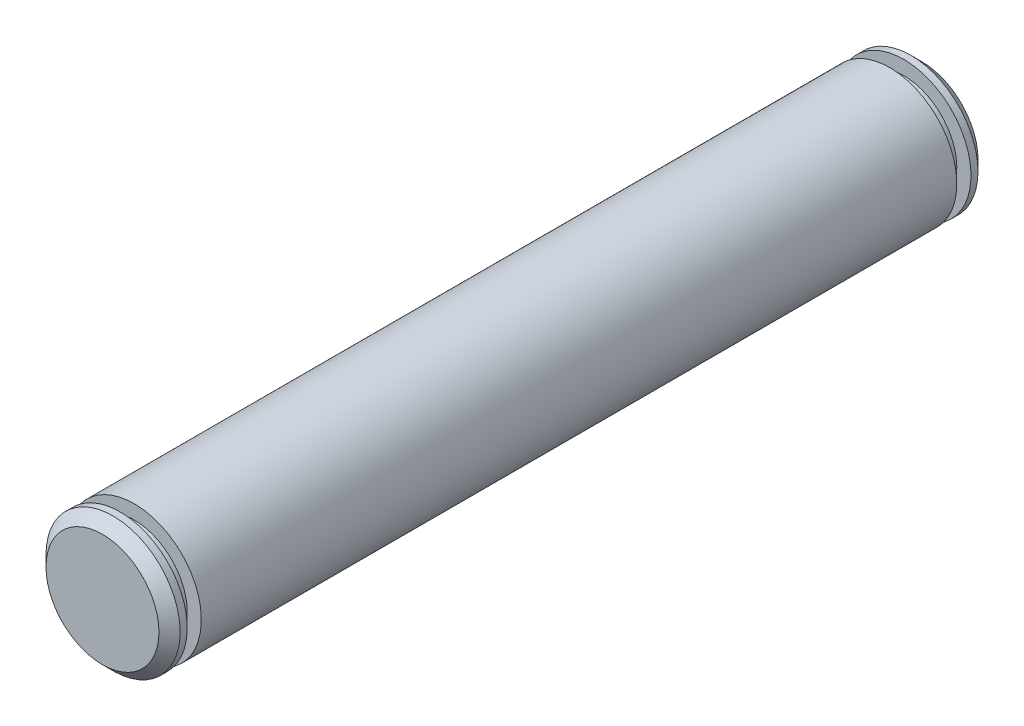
ISO-10303-21;
HEADER;
FILE_DESCRIPTION(('STEP AP214'),'2;1');
FILE_NAME('part.step','',(''),(''),'','','');
FILE_SCHEMA(('AUTOMOTIVE_DESIGN { 1 0 10303 214 1 1 1 1 }'));
ENDSEC;
DATA;
#1=APPLICATION_CONTEXT('core data for automotive mechanical design processes');
#2=APPLICATION_PROTOCOL_DEFINITION('international standard','automotive_design',2000,#1);
#3=PRODUCT_CONTEXT('',#1,'mechanical');
#4=PRODUCT('Part','Part','',(#3));
#5=PRODUCT_RELATED_PRODUCT_CATEGORY('part','',(#4));
#6=PRODUCT_DEFINITION_FORMATION('','',#4);
#7=PRODUCT_DEFINITION_CONTEXT('part definition',#1,'design');
#8=PRODUCT_DEFINITION('design','',#6,#7);
#9=PRODUCT_DEFINITION_SHAPE('','',#8);
#10=(LENGTH_UNIT() NAMED_UNIT(*) SI_UNIT(.MILLI.,.METRE.));
#11=(NAMED_UNIT(*) PLANE_ANGLE_UNIT() SI_UNIT($,.RADIAN.));
#12=(NAMED_UNIT(*) SI_UNIT($,.STERADIAN.) SOLID_ANGLE_UNIT());
#13=UNCERTAINTY_MEASURE_WITH_UNIT(LENGTH_MEASURE(1.E-05),#10,'distance_accuracy_value','');
#14=(GEOMETRIC_REPRESENTATION_CONTEXT(3) GLOBAL_UNCERTAINTY_ASSIGNED_CONTEXT((#13)) GLOBAL_UNIT_ASSIGNED_CONTEXT((#10,
#11,#12)) REPRESENTATION_CONTEXT('',''));
#15=CARTESIAN_POINT('',(0.,0.,0.));
#16=DIRECTION('',(0.,0.,1.));
#17=DIRECTION('',(1.,0.,0.));
#18=AXIS2_PLACEMENT_3D('',#15,#16,#17);
#19=CARTESIAN_POINT('',(0.,0.,116.));
#20=DIRECTION('',(0.,0.,-1.));
#21=DIRECTION('',(-1.,0.,0.));
#22=AXIS2_PLACEMENT_3D('',#19,#20,#21);
#23=CYLINDRICAL_SURFACE('',#22,9.5);
#24=CARTESIAN_POINT('',(0.,0.,4.5));
#25=DIRECTION('',(0.,0.,1.));
#26=DIRECTION('',(1.,0.,0.));
#27=AXIS2_PLACEMENT_3D('',#24,#25,#26);
#28=CIRCLE('',#27,9.5);
#29=CARTESIAN_POINT('',(-9.5,0.,4.5));
#30=VERTEX_POINT('',#29);
#31=EDGE_CURVE('E61',#30,#30,#28,.T.);
#32=CARTESIAN_POINT('',(0.,0.,111.5));
#33=DIRECTION('',(0.,0.,1.));
#34=DIRECTION('',(1.,0.,0.));
#35=AXIS2_PLACEMENT_3D('',#32,#33,#34);
#36=CIRCLE('',#35,9.5);
#37=CARTESIAN_POINT('',(-9.5,0.,111.5));
#38=VERTEX_POINT('',#37);
#39=EDGE_CURVE('E57',#38,#38,#36,.T.);
#40=CARTESIAN_POINT('',(-9.5,0.,4.5));
#41=CARTESIAN_POINT('',(-9.5,0.,5.61458333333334));
#42=CARTESIAN_POINT('',(-9.5,0.,6.72916666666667));
#43=CARTESIAN_POINT('',(-9.5,0.,8.95833333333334));
#44=CARTESIAN_POINT('',(-9.5,0.,10.0729166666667));
#45=CARTESIAN_POINT('',(-9.5,0.,12.3020833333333));
#46=CARTESIAN_POINT('',(-9.5,0.,13.4166666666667));
#47=CARTESIAN_POINT('',(-9.5,0.,15.6458333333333));
#48=CARTESIAN_POINT('',(-9.5,0.,16.7604166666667));
#49=CARTESIAN_POINT('',(-9.5,0.,18.9895833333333));
#50=CARTESIAN_POINT('',(-9.5,0.,20.1041666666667));
#51=CARTESIAN_POINT('',(-9.5,0.,22.3333333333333));
#52=CARTESIAN_POINT('',(-9.5,0.,23.4479166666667));
#53=CARTESIAN_POINT('',(-9.5,0.,25.6770833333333));
#54=CARTESIAN_POINT('',(-9.5,0.,26.7916666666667));
#55=CARTESIAN_POINT('',(-9.5,0.,29.0208333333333));
#56=CARTESIAN_POINT('',(-9.5,0.,30.1354166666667));
#57=CARTESIAN_POINT('',(-9.5,0.,32.3645833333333));
#58=CARTESIAN_POINT('',(-9.5,0.,33.4791666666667));
#59=CARTESIAN_POINT('',(-9.5,0.,35.7083333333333));
#60=CARTESIAN_POINT('',(-9.5,0.,36.8229166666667));
#61=CARTESIAN_POINT('',(-9.5,0.,39.0520833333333));
#62=CARTESIAN_POINT('',(-9.5,0.,40.1666666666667));
#63=CARTESIAN_POINT('',(-9.5,0.,42.3958333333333));
#64=CARTESIAN_POINT('',(-9.5,0.,43.5104166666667));
#65=CARTESIAN_POINT('',(-9.5,0.,45.7395833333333));
#66=CARTESIAN_POINT('',(-9.5,0.,46.8541666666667));
#67=CARTESIAN_POINT('',(-9.5,0.,49.0833333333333));
#68=CARTESIAN_POINT('',(-9.5,0.,50.1979166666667));
#69=CARTESIAN_POINT('',(-9.5,0.,52.4270833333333));
#70=CARTESIAN_POINT('',(-9.5,0.,53.5416666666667));
#71=CARTESIAN_POINT('',(-9.5,0.,55.7708333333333));
#72=CARTESIAN_POINT('',(-9.5,0.,56.8854166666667));
#73=CARTESIAN_POINT('',(-9.5,0.,59.1145833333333));
#74=CARTESIAN_POINT('',(-9.5,0.,60.2291666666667));
#75=CARTESIAN_POINT('',(-9.5,0.,62.4583333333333));
#76=CARTESIAN_POINT('',(-9.5,0.,63.5729166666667));
#77=CARTESIAN_POINT('',(-9.5,0.,65.8020833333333));
#78=CARTESIAN_POINT('',(-9.5,0.,66.9166666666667));
#79=CARTESIAN_POINT('',(-9.5,0.,69.1458333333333));
#80=CARTESIAN_POINT('',(-9.5,0.,70.2604166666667));
#81=CARTESIAN_POINT('',(-9.5,0.,72.4895833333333));
#82=CARTESIAN_POINT('',(-9.5,0.,73.6041666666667));
#83=CARTESIAN_POINT('',(-9.5,0.,75.8333333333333));
#84=CARTESIAN_POINT('',(-9.5,0.,76.9479166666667));
#85=CARTESIAN_POINT('',(-9.5,0.,79.1770833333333));
#86=CARTESIAN_POINT('',(-9.5,0.,80.2916666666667));
#87=CARTESIAN_POINT('',(-9.5,0.,82.5208333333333));
#88=CARTESIAN_POINT('',(-9.5,0.,83.6354166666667));
#89=CARTESIAN_POINT('',(-9.5,0.,85.8645833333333));
#90=CARTESIAN_POINT('',(-9.5,0.,86.9791666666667));
#91=CARTESIAN_POINT('',(-9.5,0.,89.2083333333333));
#92=CARTESIAN_POINT('',(-9.5,0.,90.3229166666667));
#93=CARTESIAN_POINT('',(-9.5,0.,92.5520833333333));
#94=CARTESIAN_POINT('',(-9.5,0.,93.6666666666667));
#95=CARTESIAN_POINT('',(-9.5,0.,95.8958333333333));
#96=CARTESIAN_POINT('',(-9.5,0.,97.0104166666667));
#97=CARTESIAN_POINT('',(-9.5,0.,99.2395833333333));
#98=CARTESIAN_POINT('',(-9.5,0.,100.354166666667));
#99=CARTESIAN_POINT('',(-9.5,0.,102.583333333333));
#100=CARTESIAN_POINT('',(-9.5,0.,103.697916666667));
#101=CARTESIAN_POINT('',(-9.5,0.,105.927083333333));
#102=CARTESIAN_POINT('',(-9.5,0.,107.041666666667));
#103=CARTESIAN_POINT('',(-9.5,0.,109.270833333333));
#104=CARTESIAN_POINT('',(-9.5,0.,110.385416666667));
#105=CARTESIAN_POINT('',(-9.5,0.,111.5));
#106=B_SPLINE_CURVE_WITH_KNOTS('',3,(#40,#41,#42,#43,#44,#45,#46,#47,#48,#49,#50,#51,#52,#53,
#54,#55,#56,#57,#58,#59,#60,#61,#62,#63,#64,#65,#66,#67,#68,#69,#70,#71,#72,#73,#74,#75,#76,#77,
#78,#79,#80,#81,#82,#83,#84,#85,#86,#87,#88,#89,#90,#91,#92,#93,#94,#95,#96,#97,#98,#99,#100,
#101,#102,#103,#104,#105),.UNSPECIFIED.,.F.,.F.,(4,2,2,2,2,2,2,2,2,2,2,2,2,2,2,2,2,2,2,2,2,2,2,
2,2,2,2,2,2,2,2,2,4),(0.,3.34375000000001,6.6875,10.03125,13.375,16.71875,20.0625,23.40625,
26.75,30.09375,33.4375,36.78125,40.125,43.46875,46.8125,50.15625,53.5,56.84375,60.1875,63.53125,
66.875,70.21875,73.5625,76.90625,80.25,83.59375,86.9375,90.28125,93.625,96.96875,100.3125,
103.65625,107.),.UNSPECIFIED.);
#107=EDGE_CURVE('BSEAM37',#30,#38,#106,.T.);
#108=ORIENTED_EDGE('',*,*,#31,.T.);
#109=ORIENTED_EDGE('',*,*,#39,.F.);
#110=ORIENTED_EDGE('',*,*,#107,.T.);
#111=ORIENTED_EDGE('',*,*,#107,.F.);
#112=EDGE_LOOP('',(#108,#110,#109,#111));
#113=FACE_BOUND('',#112,.T.);
#114=ADVANCED_FACE('F37',(#113),#23,.T.);
#115=CARTESIAN_POINT('',(0.,0.,111.5));
#116=DIRECTION('',(0.,0.,1.));
#117=DIRECTION('',(1.,0.,0.));
#118=AXIS2_PLACEMENT_3D('',#115,#116,#117);
#119=PLANE('',#118);
#120=CARTESIAN_POINT('',(0.,0.,111.5));
#121=DIRECTION('',(0.,0.,1.));
#122=DIRECTION('',(1.,0.,0.));
#123=AXIS2_PLACEMENT_3D('',#120,#121,#122);
#124=CIRCLE('',#123,7.5);
#125=CARTESIAN_POINT('',(7.5,0.,111.5));
#126=VERTEX_POINT('',#125);
#127=EDGE_CURVE('E58',#126,#126,#124,.T.);
#128=ORIENTED_EDGE('',*,*,#127,.F.);
#129=EDGE_LOOP('',(#128));
#130=FACE_BOUND('',#129,.T.);
#131=ORIENTED_EDGE('',*,*,#39,.T.);
#132=EDGE_LOOP('',(#131));
#133=FACE_BOUND('',#132,.T.);
#134=ADVANCED_FACE('F101',(#130,#133),#119,.T.);
#135=CARTESIAN_POINT('',(0.,0.,113.5));
#136=DIRECTION('',(0.,0.,1.));
#137=DIRECTION('',(1.,0.,0.));
#138=AXIS2_PLACEMENT_3D('',#135,#136,#137);
#139=PLANE('',#138);
#140=CARTESIAN_POINT('',(0.,0.,113.5));
#141=DIRECTION('',(0.,0.,1.));
#142=DIRECTION('',(1.,0.,0.));
#143=AXIS2_PLACEMENT_3D('',#140,#141,#142);
#144=CIRCLE('',#143,7.5);
#145=CARTESIAN_POINT('',(7.5,0.,113.5));
#146=VERTEX_POINT('',#145);
#147=EDGE_CURVE('E67',#146,#146,#144,.T.);
#148=ORIENTED_EDGE('',*,*,#147,.T.);
#149=EDGE_LOOP('',(#148));
#150=FACE_BOUND('',#149,.T.);
#151=CARTESIAN_POINT('',(0.,0.,113.5));
#152=DIRECTION('',(0.,0.,1.));
#153=DIRECTION('',(1.,0.,0.));
#154=AXIS2_PLACEMENT_3D('',#151,#152,#153);
#155=CIRCLE('',#154,9.5);
#156=CARTESIAN_POINT('',(-9.5,0.,113.5));
#157=VERTEX_POINT('',#156);
#158=EDGE_CURVE('E54',#157,#157,#155,.T.);
#159=ORIENTED_EDGE('',*,*,#158,.F.);
#160=EDGE_LOOP('',(#159));
#161=FACE_BOUND('',#160,.T.);
#162=ADVANCED_FACE('F105',(#150,#161),#139,.F.);
#163=CARTESIAN_POINT('',(0.,0.,111.5));
#164=DIRECTION('',(0.,0.,1.));
#165=DIRECTION('',(1.,0.,0.));
#166=AXIS2_PLACEMENT_3D('',#163,#164,#165);
#167=CYLINDRICAL_SURFACE('',#166,7.5);
#168=ORIENTED_EDGE('',*,*,#127,.T.);
#169=EDGE_LOOP('',(#168));
#170=FACE_BOUND('',#169,.T.);
#171=ORIENTED_EDGE('',*,*,#147,.F.);
#172=EDGE_LOOP('',(#171));
#173=FACE_BOUND('',#172,.T.);
#174=ADVANCED_FACE('F128',(#170,#173),#167,.T.);
#175=CARTESIAN_POINT('',(0.,0.,116.));
#176=DIRECTION('',(0.,0.,1.));
#177=DIRECTION('',(1.,0.,0.));
#178=AXIS2_PLACEMENT_3D('',#175,#176,#177);
#179=PLANE('',#178);
#180=CARTESIAN_POINT('',(0.,0.,116.));
#181=DIRECTION('',(0.,0.,1.));
#182=DIRECTION('',(1.,0.,0.));
#183=AXIS2_PLACEMENT_3D('',#180,#181,#182);
#184=CIRCLE('',#183,8.);
#185=CARTESIAN_POINT('',(8.,0.,116.));
#186=VERTEX_POINT('',#185);
#187=EDGE_CURVE('E60',#186,#186,#184,.T.);
#188=ORIENTED_EDGE('',*,*,#187,.T.);
#189=EDGE_LOOP('',(#188));
#190=FACE_BOUND('',#189,.T.);
#191=ADVANCED_FACE('F119',(#190),#179,.T.);
#192=CARTESIAN_POINT('',(0.,0.,116.));
#193=DIRECTION('',(0.,0.,-1.));
#194=DIRECTION('',(-1.,0.,0.));
#195=AXIS2_PLACEMENT_3D('',#192,#193,#194);
#196=CONICAL_SURFACE('',#195,8.,0.785398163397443);
#197=CARTESIAN_POINT('',(0.,0.,114.5));
#198=DIRECTION('',(0.,0.,1.));
#199=DIRECTION('',(1.,0.,0.));
#200=AXIS2_PLACEMENT_3D('',#197,#198,#199);
#201=CIRCLE('',#200,9.5);
#202=CARTESIAN_POINT('',(-9.5,0.,114.5));
#203=VERTEX_POINT('',#202);
#204=EDGE_CURVE('E45',#203,#203,#201,.F.);
#205=ORIENTED_EDGE('',*,*,#204,.F.);
#206=EDGE_LOOP('',(#205));
#207=FACE_BOUND('',#206,.T.);
#208=ORIENTED_EDGE('',*,*,#187,.F.);
#209=EDGE_LOOP('',(#208));
#210=FACE_BOUND('',#209,.T.);
#211=ADVANCED_FACE('F110',(#207,#210),#196,.T.);
#212=CARTESIAN_POINT('',(-9.5,0.,113.5));
#213=CARTESIAN_POINT('',(-9.5,0.,113.510416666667));
#214=CARTESIAN_POINT('',(-9.5,0.,113.520833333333));
#215=CARTESIAN_POINT('',(-9.5,0.,113.541666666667));
#216=CARTESIAN_POINT('',(-9.5,0.,113.552083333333));
#217=CARTESIAN_POINT('',(-9.5,0.,113.572916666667));
#218=CARTESIAN_POINT('',(-9.5,0.,113.583333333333));
#219=CARTESIAN_POINT('',(-9.5,0.,113.604166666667));
#220=CARTESIAN_POINT('',(-9.5,0.,113.614583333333));
#221=CARTESIAN_POINT('',(-9.5,0.,113.635416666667));
#222=CARTESIAN_POINT('',(-9.5,0.,113.645833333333));
#223=CARTESIAN_POINT('',(-9.5,0.,113.666666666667));
#224=CARTESIAN_POINT('',(-9.5,0.,113.677083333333));
#225=CARTESIAN_POINT('',(-9.5,0.,113.697916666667));
#226=CARTESIAN_POINT('',(-9.5,0.,113.708333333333));
#227=CARTESIAN_POINT('',(-9.5,0.,113.729166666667));
#228=CARTESIAN_POINT('',(-9.5,0.,113.739583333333));
#229=CARTESIAN_POINT('',(-9.5,0.,113.760416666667));
#230=CARTESIAN_POINT('',(-9.5,0.,113.770833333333));
#231=CARTESIAN_POINT('',(-9.5,0.,113.791666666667));
#232=CARTESIAN_POINT('',(-9.5,0.,113.802083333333));
#233=CARTESIAN_POINT('',(-9.5,0.,113.822916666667));
#234=CARTESIAN_POINT('',(-9.5,0.,113.833333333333));
#235=CARTESIAN_POINT('',(-9.5,0.,113.854166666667));
#236=CARTESIAN_POINT('',(-9.5,0.,113.864583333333));
#237=CARTESIAN_POINT('',(-9.5,0.,113.885416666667));
#238=CARTESIAN_POINT('',(-9.5,0.,113.895833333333));
#239=CARTESIAN_POINT('',(-9.5,0.,113.916666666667));
#240=CARTESIAN_POINT('',(-9.5,0.,113.927083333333));
#241=CARTESIAN_POINT('',(-9.5,0.,113.947916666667));
#242=CARTESIAN_POINT('',(-9.5,0.,113.958333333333));
#243=CARTESIAN_POINT('',(-9.5,0.,113.979166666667));
#244=CARTESIAN_POINT('',(-9.5,0.,113.989583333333));
#245=CARTESIAN_POINT('',(-9.5,0.,114.010416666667));
#246=CARTESIAN_POINT('',(-9.5,0.,114.020833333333));
#247=CARTESIAN_POINT('',(-9.5,0.,114.041666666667));
#248=CARTESIAN_POINT('',(-9.5,0.,114.052083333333));
#249=CARTESIAN_POINT('',(-9.5,0.,114.072916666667));
#250=CARTESIAN_POINT('',(-9.5,0.,114.083333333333));
#251=CARTESIAN_POINT('',(-9.5,0.,114.104166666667));
#252=CARTESIAN_POINT('',(-9.5,0.,114.114583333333));
#253=CARTESIAN_POINT('',(-9.5,0.,114.135416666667));
#254=CARTESIAN_POINT('',(-9.5,0.,114.145833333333));
#255=CARTESIAN_POINT('',(-9.5,0.,114.166666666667));
#256=CARTESIAN_POINT('',(-9.5,0.,114.177083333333));
#257=CARTESIAN_POINT('',(-9.5,0.,114.197916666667));
#258=CARTESIAN_POINT('',(-9.5,0.,114.208333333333));
#259=CARTESIAN_POINT('',(-9.5,0.,114.229166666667));
#260=CARTESIAN_POINT('',(-9.5,0.,114.239583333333));
#261=CARTESIAN_POINT('',(-9.5,0.,114.260416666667));
#262=CARTESIAN_POINT('',(-9.5,0.,114.270833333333));
#263=CARTESIAN_POINT('',(-9.5,0.,114.291666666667));
#264=CARTESIAN_POINT('',(-9.5,0.,114.302083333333));
#265=CARTESIAN_POINT('',(-9.5,0.,114.322916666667));
#266=CARTESIAN_POINT('',(-9.5,0.,114.333333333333));
#267=CARTESIAN_POINT('',(-9.5,0.,114.354166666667));
#268=CARTESIAN_POINT('',(-9.5,0.,114.364583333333));
#269=CARTESIAN_POINT('',(-9.5,0.,114.385416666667));
#270=CARTESIAN_POINT('',(-9.5,0.,114.395833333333));
#271=CARTESIAN_POINT('',(-9.5,0.,114.416666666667));
#272=CARTESIAN_POINT('',(-9.5,0.,114.427083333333));
#273=CARTESIAN_POINT('',(-9.5,0.,114.447916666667));
#274=CARTESIAN_POINT('',(-9.5,0.,114.458333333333));
#275=CARTESIAN_POINT('',(-9.5,0.,114.479166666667));
#276=CARTESIAN_POINT('',(-9.5,0.,114.489583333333));
#277=CARTESIAN_POINT('',(-9.5,0.,114.5));
#278=B_SPLINE_CURVE_WITH_KNOTS('',3,(#212,#213,#214,#215,#216,#217,#218,#219,#220,#221,#222,
#223,#224,#225,#226,#227,#228,#229,#230,#231,#232,#233,#234,#235,#236,#237,#238,#239,#240,#241,
#242,#243,#244,#245,#246,#247,#248,#249,#250,#251,#252,#253,#254,#255,#256,#257,#258,#259,#260,
#261,#262,#263,#264,#265,#266,#267,#268,#269,#270,#271,#272,#273,#274,#275,#276,#277),
.UNSPECIFIED.,.F.,.F.,(4,2,2,2,2,2,2,2,2,2,2,2,2,2,2,2,2,2,2,2,2,2,2,2,2,2,2,2,2,2,2,2,4),(0.,
0.0312499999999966,0.0624999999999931,0.0937499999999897,0.124999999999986,0.156249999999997,
0.187499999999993,0.21874999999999,0.249999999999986,0.281249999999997,0.312499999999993,
0.34374999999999,0.374999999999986,0.406249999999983,0.437499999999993,0.46874999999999,
0.499999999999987,0.531249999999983,0.56249999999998,0.59374999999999,0.624999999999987,
0.656249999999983,0.68749999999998,0.71874999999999,0.749999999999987,0.781249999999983,
0.81249999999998,0.843749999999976,0.874999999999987,0.906249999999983,0.93749999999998,
0.968749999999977,0.999999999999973),.UNSPECIFIED.);
#279=EDGE_CURVE('BSEAM39',#157,#203,#278,.T.);
#280=ORIENTED_EDGE('',*,*,#158,.T.);
#281=ORIENTED_EDGE('',*,*,#204,.T.);
#282=ORIENTED_EDGE('',*,*,#279,.T.);
#283=ORIENTED_EDGE('',*,*,#279,.F.);
#284=EDGE_LOOP('',(#280,#282,#281,#283));
#285=FACE_BOUND('',#284,.T.);
#286=ADVANCED_FACE('F39',(#285),#23,.T.);
#287=CARTESIAN_POINT('',(0.,0.,2.5));
#288=DIRECTION('',(0.,0.,1.));
#289=DIRECTION('',(1.,0.,0.));
#290=AXIS2_PLACEMENT_3D('',#287,#288,#289);
#291=PLANE('',#290);
#292=CARTESIAN_POINT('',(0.,0.,2.5));
#293=DIRECTION('',(0.,0.,1.));
#294=DIRECTION('',(1.,0.,0.));
#295=AXIS2_PLACEMENT_3D('',#292,#293,#294);
#296=CIRCLE('',#295,7.5);
#297=CARTESIAN_POINT('',(7.5,0.,2.5));
#298=VERTEX_POINT('',#297);
#299=EDGE_CURVE('E63',#298,#298,#296,.T.);
#300=ORIENTED_EDGE('',*,*,#299,.F.);
#301=EDGE_LOOP('',(#300));
#302=FACE_BOUND('',#301,.T.);
#303=CARTESIAN_POINT('',(0.,0.,2.5));
#304=DIRECTION('',(0.,0.,1.));
#305=DIRECTION('',(1.,0.,0.));
#306=AXIS2_PLACEMENT_3D('',#303,#304,#305);
#307=CIRCLE('',#306,9.5);
#308=CARTESIAN_POINT('',(-9.5,0.,2.5));
#309=VERTEX_POINT('',#308);
#310=EDGE_CURVE('E41',#309,#309,#307,.T.);
#311=ORIENTED_EDGE('',*,*,#310,.T.);
#312=EDGE_LOOP('',(#311));
#313=FACE_BOUND('',#312,.T.);
#314=ADVANCED_FACE('F109',(#302,#313),#291,.T.);
#315=CARTESIAN_POINT('',(0.,0.,4.5));
#316=DIRECTION('',(0.,0.,1.));
#317=DIRECTION('',(1.,0.,0.));
#318=AXIS2_PLACEMENT_3D('',#315,#316,#317);
#319=PLANE('',#318);
#320=CARTESIAN_POINT('',(0.,0.,4.5));
#321=DIRECTION('',(0.,0.,1.));
#322=DIRECTION('',(1.,0.,0.));
#323=AXIS2_PLACEMENT_3D('',#320,#321,#322);
#324=CIRCLE('',#323,7.5);
#325=CARTESIAN_POINT('',(7.5,0.,4.5));
#326=VERTEX_POINT('',#325);
#327=EDGE_CURVE('E69',#326,#326,#324,.T.);
#328=ORIENTED_EDGE('',*,*,#327,.T.);
#329=EDGE_LOOP('',(#328));
#330=FACE_BOUND('',#329,.T.);
#331=ORIENTED_EDGE('',*,*,#31,.F.);
#332=EDGE_LOOP('',(#331));
#333=FACE_BOUND('',#332,.T.);
#334=ADVANCED_FACE('F116',(#330,#333),#319,.F.);
#335=CARTESIAN_POINT('',(0.,0.,2.5));
#336=DIRECTION('',(0.,0.,1.));
#337=DIRECTION('',(1.,0.,0.));
#338=AXIS2_PLACEMENT_3D('',#335,#336,#337);
#339=CYLINDRICAL_SURFACE('',#338,7.5);
#340=ORIENTED_EDGE('',*,*,#299,.T.);
#341=EDGE_LOOP('',(#340));
#342=FACE_BOUND('',#341,.T.);
#343=ORIENTED_EDGE('',*,*,#327,.F.);
#344=EDGE_LOOP('',(#343));
#345=FACE_BOUND('',#344,.T.);
#346=ADVANCED_FACE('F96',(#342,#345),#339,.T.);
#347=CARTESIAN_POINT('',(0.,0.,0.));
#348=DIRECTION('',(0.,0.,1.));
#349=DIRECTION('',(1.,0.,0.));
#350=AXIS2_PLACEMENT_3D('',#347,#348,#349);
#351=PLANE('',#350);
#352=CARTESIAN_POINT('',(0.,0.,0.));
#353=DIRECTION('',(0.,0.,1.));
#354=DIRECTION('',(1.,0.,0.));
#355=AXIS2_PLACEMENT_3D('',#352,#353,#354);
#356=CIRCLE('',#355,7.99999999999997);
#357=CARTESIAN_POINT('',(7.99999999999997,0.,0.));
#358=VERTEX_POINT('',#357);
#359=EDGE_CURVE('E10',#358,#358,#356,.F.);
#360=ORIENTED_EDGE('',*,*,#359,.T.);
#361=EDGE_LOOP('',(#360));
#362=FACE_BOUND('',#361,.T.);
#363=ADVANCED_FACE('F89',(#362),#351,.F.);
#364=CARTESIAN_POINT('',(0.,0.,1.50000000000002));
#365=DIRECTION('',(0.,0.,1.));
#366=DIRECTION('',(1.,0.,0.));
#367=AXIS2_PLACEMENT_3D('',#364,#365,#366);
#368=CONICAL_SURFACE('',#367,9.5,0.785398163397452);
#369=ORIENTED_EDGE('',*,*,#359,.F.);
#370=EDGE_LOOP('',(#369));
#371=FACE_BOUND('',#370,.T.);
#372=CARTESIAN_POINT('',(0.,0.,1.50000000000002));
#373=DIRECTION('',(0.,0.,1.));
#374=DIRECTION('',(1.,0.,0.));
#375=AXIS2_PLACEMENT_3D('',#372,#373,#374);
#376=CIRCLE('',#375,9.5);
#377=CARTESIAN_POINT('',(-9.5,0.,1.5));
#378=VERTEX_POINT('',#377);
#379=EDGE_CURVE('E50',#378,#378,#376,.T.);
#380=ORIENTED_EDGE('',*,*,#379,.F.);
#381=EDGE_LOOP('',(#380));
#382=FACE_BOUND('',#381,.T.);
#383=ADVANCED_FACE('F87',(#371,#382),#368,.T.);
#384=CARTESIAN_POINT('',(-9.5,0.,1.5));
#385=CARTESIAN_POINT('',(-9.5,0.,1.51041666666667));
#386=CARTESIAN_POINT('',(-9.5,0.,1.52083333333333));
#387=CARTESIAN_POINT('',(-9.5,0.,1.54166666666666));
#388=CARTESIAN_POINT('',(-9.5,0.,1.55208333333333));
#389=CARTESIAN_POINT('',(-9.5,0.,1.57291666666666));
#390=CARTESIAN_POINT('',(-9.5,0.,1.58333333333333));
#391=CARTESIAN_POINT('',(-9.5,0.,1.60416666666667));
#392=CARTESIAN_POINT('',(-9.5,0.,1.61458333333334));
#393=CARTESIAN_POINT('',(-9.5,0.,1.63541666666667));
#394=CARTESIAN_POINT('',(-9.5,0.,1.64583333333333));
#395=CARTESIAN_POINT('',(-9.5,0.,1.66666666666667));
#396=CARTESIAN_POINT('',(-9.5,0.,1.67708333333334));
#397=CARTESIAN_POINT('',(-9.5,0.,1.69791666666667));
#398=CARTESIAN_POINT('',(-9.5,0.,1.70833333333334));
#399=CARTESIAN_POINT('',(-9.5,0.,1.72916666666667));
#400=CARTESIAN_POINT('',(-9.5,0.,1.73958333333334));
#401=CARTESIAN_POINT('',(-9.5,0.,1.76041666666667));
#402=CARTESIAN_POINT('',(-9.5,0.,1.77083333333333));
#403=CARTESIAN_POINT('',(-9.5,0.,1.79166666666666));
#404=CARTESIAN_POINT('',(-9.5,0.,1.80208333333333));
#405=CARTESIAN_POINT('',(-9.5,0.,1.82291666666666));
#406=CARTESIAN_POINT('',(-9.5,0.,1.83333333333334));
#407=CARTESIAN_POINT('',(-9.5,0.,1.85416666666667));
#408=CARTESIAN_POINT('',(-9.5,0.,1.86458333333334));
#409=CARTESIAN_POINT('',(-9.5,0.,1.88541666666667));
#410=CARTESIAN_POINT('',(-9.5,0.,1.89583333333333));
#411=CARTESIAN_POINT('',(-9.5,0.,1.91666666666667));
#412=CARTESIAN_POINT('',(-9.5,0.,1.92708333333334));
#413=CARTESIAN_POINT('',(-9.5,0.,1.94791666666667));
#414=CARTESIAN_POINT('',(-9.5,0.,1.95833333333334));
#415=CARTESIAN_POINT('',(-9.5,0.,1.97916666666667));
#416=CARTESIAN_POINT('',(-9.5,0.,1.98958333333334));
#417=CARTESIAN_POINT('',(-9.5,0.,2.01041666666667));
#418=CARTESIAN_POINT('',(-9.5,0.,2.02083333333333));
#419=CARTESIAN_POINT('',(-9.5,0.,2.04166666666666));
#420=CARTESIAN_POINT('',(-9.5,0.,2.05208333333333));
#421=CARTESIAN_POINT('',(-9.5,0.,2.07291666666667));
#422=CARTESIAN_POINT('',(-9.5,0.,2.08333333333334));
#423=CARTESIAN_POINT('',(-9.5,0.,2.10416666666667));
#424=CARTESIAN_POINT('',(-9.5,0.,2.11458333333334));
#425=CARTESIAN_POINT('',(-9.5,0.,2.13541666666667));
#426=CARTESIAN_POINT('',(-9.5,0.,2.14583333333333));
#427=CARTESIAN_POINT('',(-9.5,0.,2.16666666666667));
#428=CARTESIAN_POINT('',(-9.5,0.,2.17708333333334));
#429=CARTESIAN_POINT('',(-9.5,0.,2.19791666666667));
#430=CARTESIAN_POINT('',(-9.5,0.,2.20833333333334));
#431=CARTESIAN_POINT('',(-9.5,0.,2.22916666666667));
#432=CARTESIAN_POINT('',(-9.5,0.,2.23958333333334));
#433=CARTESIAN_POINT('',(-9.5,0.,2.26041666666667));
#434=CARTESIAN_POINT('',(-9.5,0.,2.27083333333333));
#435=CARTESIAN_POINT('',(-9.5,0.,2.29166666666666));
#436=CARTESIAN_POINT('',(-9.5,0.,2.30208333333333));
#437=CARTESIAN_POINT('',(-9.5,0.,2.32291666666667));
#438=CARTESIAN_POINT('',(-9.5,0.,2.33333333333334));
#439=CARTESIAN_POINT('',(-9.5,0.,2.35416666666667));
#440=CARTESIAN_POINT('',(-9.5,0.,2.36458333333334));
#441=CARTESIAN_POINT('',(-9.5,0.,2.38541666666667));
#442=CARTESIAN_POINT('',(-9.5,0.,2.39583333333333));
#443=CARTESIAN_POINT('',(-9.5,0.,2.41666666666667));
#444=CARTESIAN_POINT('',(-9.5,0.,2.42708333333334));
#445=CARTESIAN_POINT('',(-9.5,0.,2.44791666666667));
#446=CARTESIAN_POINT('',(-9.5,0.,2.45833333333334));
#447=CARTESIAN_POINT('',(-9.5,0.,2.47916666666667));
#448=CARTESIAN_POINT('',(-9.5,0.,2.48958333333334));
#449=CARTESIAN_POINT('',(-9.5,0.,2.5));
#450=B_SPLINE_CURVE_WITH_KNOTS('',3,(#384,#385,#386,#387,#388,#389,#390,#391,#392,#393,#394,
#395,#396,#397,#398,#399,#400,#401,#402,#403,#404,#405,#406,#407,#408,#409,#410,#411,#412,#413,
#414,#415,#416,#417,#418,#419,#420,#421,#422,#423,#424,#425,#426,#427,#428,#429,#430,#431,#432,
#433,#434,#435,#436,#437,#438,#439,#440,#441,#442,#443,#444,#445,#446,#447,#448,#449),
.UNSPECIFIED.,.F.,.F.,(4,2,2,2,2,2,2,2,2,2,2,2,2,2,2,2,2,2,2,2,2,2,2,2,2,2,2,2,2,2,2,2,4),(0.,
0.0312499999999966,0.0624999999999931,0.0937500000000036,0.125,0.156249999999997,
0.187500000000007,0.218750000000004,0.25,0.281249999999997,0.312499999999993,0.343750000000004,
0.375,0.406249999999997,0.437500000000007,0.468750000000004,0.5,0.531249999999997,
0.562499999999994,0.593750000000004,0.625000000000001,0.656249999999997,0.687500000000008,
0.718750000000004,0.750000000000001,0.781249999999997,0.812499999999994,0.843750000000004,
0.875000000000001,0.906249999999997,0.937500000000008,0.968750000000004,1.),.UNSPECIFIED.);
#451=EDGE_CURVE('BSEAM84',#378,#309,#450,.T.);
#452=ORIENTED_EDGE('',*,*,#379,.T.);
#453=ORIENTED_EDGE('',*,*,#310,.F.);
#454=ORIENTED_EDGE('',*,*,#451,.T.);
#455=ORIENTED_EDGE('',*,*,#451,.F.);
#456=EDGE_LOOP('',(#452,#454,#453,#455));
#457=FACE_BOUND('',#456,.T.);
#458=ADVANCED_FACE('F84',(#457),#23,.T.);
#459=CLOSED_SHELL('',(#114,#134,#162,#174,#191,#211,#286,#314,#334,#346,#363,#383,#458));
#460=MANIFOLD_SOLID_BREP('B2',#459);
#461=ADVANCED_BREP_SHAPE_REPRESENTATION('',(#18,#460),#14);
#462=SHAPE_DEFINITION_REPRESENTATION(#9,#461);
ENDSEC;
END-ISO-10303-21;
